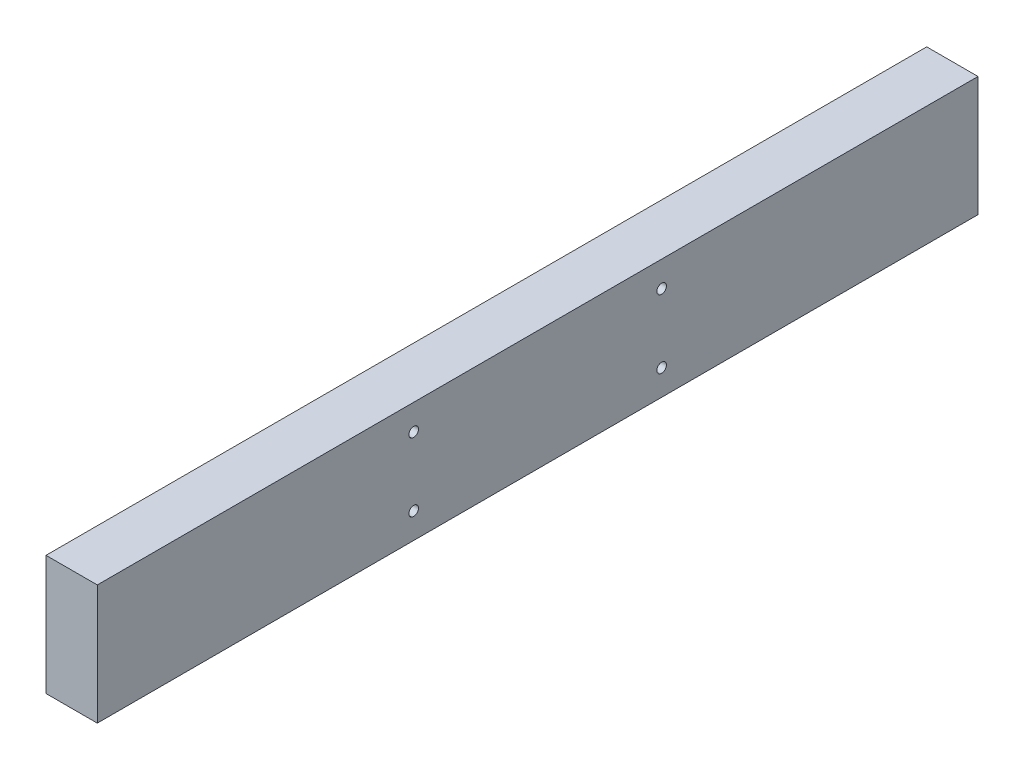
from build123d import *

# Parameters (mm, degrees)
SKETCH1_W                       = 38.1
SKETCH1_H                       = 88.9
BOSS_EXTRUDE1_DEPTH             = 654.05
F_9_32_0_28125_DIAMETER_HOLE1_D = 7.14375


with BuildPart() as part:
    # Sketch1 → Boss-Extrude1 (new body)
    with BuildSketch(Plane.XY):
        Rectangle(SKETCH1_W, SKETCH1_H)
    extrude(amount=BOSS_EXTRUDE1_DEPTH)

    # 9_32 _0.28125_ Diameter Hole1 (through all)
    with Locations(Plane.ZY.offset(19.05)):
        with Locations((234.95, 25.4), (419.1, 25.4), (419.1, -25.4), (234.95, -25.4)):
            Hole(F_9_32_0_28125_DIAMETER_HOLE1_D / 2)


solid = part.part
